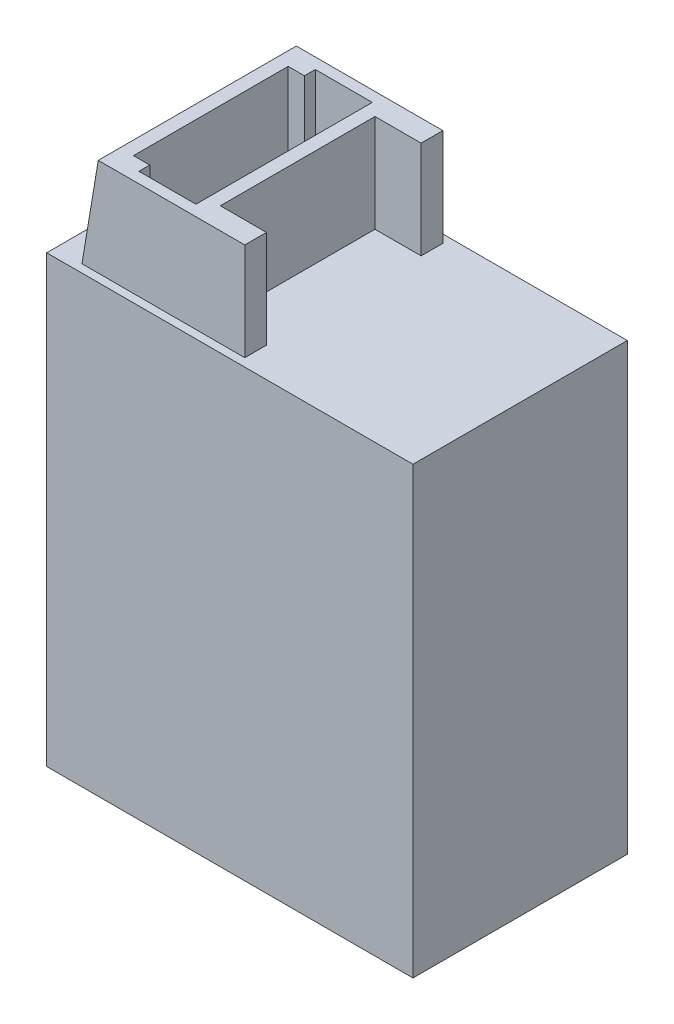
ISO-10303-21;
HEADER;
FILE_DESCRIPTION(('STEP AP214'),'2;1');
FILE_NAME('part.step','',(''),(''),'','','');
FILE_SCHEMA(('AUTOMOTIVE_DESIGN { 1 0 10303 214 1 1 1 1 }'));
ENDSEC;
DATA;
#1=APPLICATION_CONTEXT('core data for automotive mechanical design processes');
#2=APPLICATION_PROTOCOL_DEFINITION('international standard','automotive_design',2000,#1);
#3=PRODUCT_CONTEXT('',#1,'mechanical');
#4=PRODUCT('Part','Part','',(#3));
#5=PRODUCT_RELATED_PRODUCT_CATEGORY('part','',(#4));
#6=PRODUCT_DEFINITION_FORMATION('','',#4);
#7=PRODUCT_DEFINITION_CONTEXT('part definition',#1,'design');
#8=PRODUCT_DEFINITION('design','',#6,#7);
#9=PRODUCT_DEFINITION_SHAPE('','',#8);
#10=(LENGTH_UNIT() NAMED_UNIT(*) SI_UNIT(.MILLI.,.METRE.));
#11=(NAMED_UNIT(*) PLANE_ANGLE_UNIT() SI_UNIT($,.RADIAN.));
#12=(NAMED_UNIT(*) SI_UNIT($,.STERADIAN.) SOLID_ANGLE_UNIT());
#13=UNCERTAINTY_MEASURE_WITH_UNIT(LENGTH_MEASURE(1.E-05),#10,'distance_accuracy_value','');
#14=(GEOMETRIC_REPRESENTATION_CONTEXT(3) GLOBAL_UNCERTAINTY_ASSIGNED_CONTEXT((#13)) GLOBAL_UNIT_ASSIGNED_CONTEXT((#10,
#11,#12)) REPRESENTATION_CONTEXT('',''));
#15=CARTESIAN_POINT('',(0.,0.,0.));
#16=DIRECTION('',(0.,0.,1.));
#17=DIRECTION('',(1.,0.,0.));
#18=AXIS2_PLACEMENT_3D('',#15,#16,#17);
#19=CARTESIAN_POINT('',(0.,20.828,-10.033));
#20=DIRECTION('',(0.,-1.,0.));
#21=DIRECTION('',(0.,0.,-1.));
#22=AXIS2_PLACEMENT_3D('',#19,#20,#21);
#23=PLANE('',#22);
#24=DIRECTION('',(0.,0.,1.));
#25=VECTOR('',#24,1.);
#26=CARTESIAN_POINT('',(0.,20.828,0.));
#27=LINE('',#26,#25);
#28=CARTESIAN_POINT('',(0.,20.828,-10.033));
#29=VERTEX_POINT('',#28);
#30=CARTESIAN_POINT('',(0.,20.828,0.));
#31=VERTEX_POINT('',#30);
#32=EDGE_CURVE('E336',#29,#31,#27,.T.);
#33=ORIENTED_EDGE('',*,*,#32,.T.);
#34=DIRECTION('',(1.,0.,0.));
#35=VECTOR('',#34,1.);
#36=CARTESIAN_POINT('',(0.,20.828,0.));
#37=LINE('',#36,#35);
#38=CARTESIAN_POINT('',(17.145,20.828,0.));
#39=VERTEX_POINT('',#38);
#40=EDGE_CURVE('E339',#31,#39,#37,.T.);
#41=ORIENTED_EDGE('',*,*,#40,.T.);
#42=DIRECTION('',(0.,0.,-1.));
#43=VECTOR('',#42,1.);
#44=CARTESIAN_POINT('',(17.145,20.828,0.));
#45=LINE('',#44,#43);
#46=CARTESIAN_POINT('',(17.145,20.828,-10.033));
#47=VERTEX_POINT('',#46);
#48=EDGE_CURVE('E341',#39,#47,#45,.T.);
#49=ORIENTED_EDGE('',*,*,#48,.T.);
#50=DIRECTION('',(-1.,0.,0.));
#51=VECTOR('',#50,1.);
#52=CARTESIAN_POINT('',(0.,20.828,-10.033));
#53=LINE('',#52,#51);
#54=EDGE_CURVE('E343',#47,#29,#53,.T.);
#55=ORIENTED_EDGE('',*,*,#54,.T.);
#56=EDGE_LOOP('',(#33,#41,#49,#55));
#57=FACE_BOUND('',#56,.T.);
#58=DIRECTION('',(0.,0.,1.));
#59=VECTOR('',#58,1.);
#60=CARTESIAN_POINT('',(1.27,20.828,-0.381));
#61=LINE('',#60,#59);
#62=CARTESIAN_POINT('',(1.27,20.828,-1.397));
#63=VERTEX_POINT('',#62);
#64=CARTESIAN_POINT('',(1.27,20.828,-0.380999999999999));
#65=VERTEX_POINT('',#64);
#66=EDGE_CURVE('E203',#63,#65,#61,.T.);
#67=ORIENTED_EDGE('',*,*,#66,.F.);
#68=DIRECTION('',(-1.,0.,0.));
#69=VECTOR('',#68,1.);
#70=CARTESIAN_POINT('',(1.27,20.828,-1.397));
#71=LINE('',#70,#69);
#72=CARTESIAN_POINT('',(2.032,20.828,-1.397));
#73=VERTEX_POINT('',#72);
#74=EDGE_CURVE('E283',#73,#63,#71,.T.);
#75=ORIENTED_EDGE('',*,*,#74,.F.);
#76=DIRECTION('',(0.,0.,1.));
#77=VECTOR('',#76,1.);
#78=CARTESIAN_POINT('',(2.032,20.828,-1.397));
#79=LINE('',#78,#77);
#80=CARTESIAN_POINT('',(2.032,20.828,-8.636));
#81=VERTEX_POINT('',#80);
#82=EDGE_CURVE('E280',#81,#73,#79,.T.);
#83=ORIENTED_EDGE('',*,*,#82,.F.);
#84=DIRECTION('',(1.,0.,0.));
#85=VECTOR('',#84,1.);
#86=CARTESIAN_POINT('',(1.27,20.828,-8.636));
#87=LINE('',#86,#85);
#88=CARTESIAN_POINT('',(1.27,20.828,-8.636));
#89=VERTEX_POINT('',#88);
#90=EDGE_CURVE('E277',#89,#81,#87,.T.);
#91=ORIENTED_EDGE('',*,*,#90,.F.);
#92=DIRECTION('',(0.,0.,1.));
#93=VECTOR('',#92,1.);
#94=CARTESIAN_POINT('',(1.27,20.828,-8.636));
#95=LINE('',#94,#93);
#96=CARTESIAN_POINT('',(1.27,20.828,-9.652));
#97=VERTEX_POINT('',#96);
#98=EDGE_CURVE('E274',#97,#89,#95,.T.);
#99=ORIENTED_EDGE('',*,*,#98,.F.);
#100=DIRECTION('',(-1.,0.,0.));
#101=VECTOR('',#100,1.);
#102=CARTESIAN_POINT('',(1.27,20.828,-9.652));
#103=LINE('',#102,#101);
#104=CARTESIAN_POINT('',(8.89,20.828,-9.652));
#105=VERTEX_POINT('',#104);
#106=EDGE_CURVE('E272',#105,#97,#103,.T.);
#107=ORIENTED_EDGE('',*,*,#106,.F.);
#108=DIRECTION('',(0.,0.,-1.));
#109=VECTOR('',#108,1.);
#110=CARTESIAN_POINT('',(8.89,20.828,-8.636));
#111=LINE('',#110,#109);
#112=CARTESIAN_POINT('',(8.89,20.828,-8.636));
#113=VERTEX_POINT('',#112);
#114=EDGE_CURVE('E269',#113,#105,#111,.T.);
#115=ORIENTED_EDGE('',*,*,#114,.F.);
#116=DIRECTION('',(1.,0.,0.));
#117=VECTOR('',#116,1.);
#118=CARTESIAN_POINT('',(6.731,20.828,-8.636));
#119=LINE('',#118,#117);
#120=CARTESIAN_POINT('',(6.731,20.828,-8.636));
#121=VERTEX_POINT('',#120);
#122=EDGE_CURVE('E266',#121,#113,#119,.T.);
#123=ORIENTED_EDGE('',*,*,#122,.F.);
#124=DIRECTION('',(0.,0.,-1.));
#125=VECTOR('',#124,1.);
#126=CARTESIAN_POINT('',(6.731,20.828,-8.636));
#127=LINE('',#126,#125);
#128=CARTESIAN_POINT('',(6.731,20.828,-1.397));
#129=VERTEX_POINT('',#128);
#130=EDGE_CURVE('E263',#129,#121,#127,.T.);
#131=ORIENTED_EDGE('',*,*,#130,.F.);
#132=DIRECTION('',(-1.,0.,0.));
#133=VECTOR('',#132,1.);
#134=CARTESIAN_POINT('',(6.731,20.828,-1.397));
#135=LINE('',#134,#133);
#136=CARTESIAN_POINT('',(8.89,20.828,-1.397));
#137=VERTEX_POINT('',#136);
#138=EDGE_CURVE('E260',#137,#129,#135,.T.);
#139=ORIENTED_EDGE('',*,*,#138,.F.);
#140=DIRECTION('',(0.,0.,-1.));
#141=VECTOR('',#140,1.);
#142=CARTESIAN_POINT('',(8.89,20.828,-0.381));
#143=LINE('',#142,#141);
#144=CARTESIAN_POINT('',(8.89,20.828,-0.380999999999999));
#145=VERTEX_POINT('',#144);
#146=EDGE_CURVE('E257',#145,#137,#143,.T.);
#147=ORIENTED_EDGE('',*,*,#146,.F.);
#148=DIRECTION('',(1.,0.,0.));
#149=VECTOR('',#148,1.);
#150=CARTESIAN_POINT('',(1.27,20.828,-0.381));
#151=LINE('',#150,#149);
#152=EDGE_CURVE('E254',#65,#145,#151,.T.);
#153=ORIENTED_EDGE('',*,*,#152,.F.);
#154=EDGE_LOOP('',(#67,#75,#83,#91,#99,#107,#115,#123,#131,#139,#147,#153));
#155=FACE_BOUND('',#154,.T.);
#156=ADVANCED_FACE('F26',(#57,#155),#23,.F.);
#157=CARTESIAN_POINT('',(0.,20.828,0.));
#158=DIRECTION('',(1.,0.,0.));
#159=DIRECTION('',(0.,0.,-1.));
#160=AXIS2_PLACEMENT_3D('',#157,#158,#159);
#161=PLANE('',#160);
#162=DIRECTION('',(0.,0.,1.));
#163=VECTOR('',#162,1.);
#164=CARTESIAN_POINT('',(0.,0.,0.));
#165=LINE('',#164,#163);
#166=CARTESIAN_POINT('',(0.,0.,-10.033));
#167=VERTEX_POINT('',#166);
#168=CARTESIAN_POINT('',(0.,0.,0.));
#169=VERTEX_POINT('',#168);
#170=EDGE_CURVE('E327',#167,#169,#165,.T.);
#171=ORIENTED_EDGE('',*,*,#170,.T.);
#172=DIRECTION('',(0.,-1.,0.));
#173=VECTOR('',#172,1.);
#174=CARTESIAN_POINT('',(0.,20.828,0.));
#175=LINE('',#174,#173);
#176=EDGE_CURVE('E354',#31,#169,#175,.T.);
#177=ORIENTED_EDGE('',*,*,#176,.F.);
#178=ORIENTED_EDGE('',*,*,#32,.F.);
#179=DIRECTION('',(0.,-1.,0.));
#180=VECTOR('',#179,1.);
#181=CARTESIAN_POINT('',(0.,20.828,-10.033));
#182=LINE('',#181,#180);
#183=EDGE_CURVE('E345',#29,#167,#182,.T.);
#184=ORIENTED_EDGE('',*,*,#183,.T.);
#185=EDGE_LOOP('',(#171,#177,#178,#184));
#186=FACE_BOUND('',#185,.T.);
#187=ADVANCED_FACE('F28',(#186),#161,.F.);
#188=CARTESIAN_POINT('',(0.,20.828,0.));
#189=DIRECTION('',(0.,0.,-1.));
#190=DIRECTION('',(-1.,0.,0.));
#191=AXIS2_PLACEMENT_3D('',#188,#189,#190);
#192=PLANE('',#191);
#193=DIRECTION('',(1.,0.,0.));
#194=VECTOR('',#193,1.);
#195=CARTESIAN_POINT('',(0.,0.,0.));
#196=LINE('',#195,#194);
#197=CARTESIAN_POINT('',(17.145,0.,0.));
#198=VERTEX_POINT('',#197);
#199=EDGE_CURVE('E330',#169,#198,#196,.T.);
#200=ORIENTED_EDGE('',*,*,#199,.T.);
#201=DIRECTION('',(0.,-1.,0.));
#202=VECTOR('',#201,1.);
#203=CARTESIAN_POINT('',(17.145,20.828,0.));
#204=LINE('',#203,#202);
#205=EDGE_CURVE('E351',#39,#198,#204,.T.);
#206=ORIENTED_EDGE('',*,*,#205,.F.);
#207=ORIENTED_EDGE('',*,*,#40,.F.);
#208=ORIENTED_EDGE('',*,*,#176,.T.);
#209=EDGE_LOOP('',(#200,#206,#207,#208));
#210=FACE_BOUND('',#209,.T.);
#211=ADVANCED_FACE('F425',(#210),#192,.F.);
#212=CARTESIAN_POINT('',(17.145,20.828,0.));
#213=DIRECTION('',(-1.,0.,0.));
#214=DIRECTION('',(0.,0.,1.));
#215=AXIS2_PLACEMENT_3D('',#212,#213,#214);
#216=PLANE('',#215);
#217=DIRECTION('',(0.,0.,-1.));
#218=VECTOR('',#217,1.);
#219=CARTESIAN_POINT('',(17.145,0.,0.));
#220=LINE('',#219,#218);
#221=CARTESIAN_POINT('',(17.145,0.,-10.033));
#222=VERTEX_POINT('',#221);
#223=EDGE_CURVE('E332',#198,#222,#220,.T.);
#224=ORIENTED_EDGE('',*,*,#223,.T.);
#225=DIRECTION('',(0.,-1.,0.));
#226=VECTOR('',#225,1.);
#227=CARTESIAN_POINT('',(17.145,20.828,-10.033));
#228=LINE('',#227,#226);
#229=EDGE_CURVE('E348',#47,#222,#228,.T.);
#230=ORIENTED_EDGE('',*,*,#229,.F.);
#231=ORIENTED_EDGE('',*,*,#48,.F.);
#232=ORIENTED_EDGE('',*,*,#205,.T.);
#233=EDGE_LOOP('',(#224,#230,#231,#232));
#234=FACE_BOUND('',#233,.T.);
#235=ADVANCED_FACE('F477',(#234),#216,.F.);
#236=CARTESIAN_POINT('',(0.,20.828,-10.033));
#237=DIRECTION('',(0.,0.,1.));
#238=DIRECTION('',(1.,0.,0.));
#239=AXIS2_PLACEMENT_3D('',#236,#237,#238);
#240=PLANE('',#239);
#241=DIRECTION('',(-1.,0.,0.));
#242=VECTOR('',#241,1.);
#243=CARTESIAN_POINT('',(0.,0.,-10.033));
#244=LINE('',#243,#242);
#245=EDGE_CURVE('E334',#222,#167,#244,.T.);
#246=ORIENTED_EDGE('',*,*,#245,.T.);
#247=ORIENTED_EDGE('',*,*,#183,.F.);
#248=ORIENTED_EDGE('',*,*,#54,.F.);
#249=ORIENTED_EDGE('',*,*,#229,.T.);
#250=EDGE_LOOP('',(#246,#247,#248,#249));
#251=FACE_BOUND('',#250,.T.);
#252=ADVANCED_FACE('F471',(#251),#240,.F.);
#253=CARTESIAN_POINT('',(0.,0.,-10.033));
#254=DIRECTION('',(0.,-1.,0.));
#255=DIRECTION('',(0.,0.,-1.));
#256=AXIS2_PLACEMENT_3D('',#253,#254,#255);
#257=PLANE('',#256);
#258=ORIENTED_EDGE('',*,*,#170,.F.);
#259=ORIENTED_EDGE('',*,*,#245,.F.);
#260=ORIENTED_EDGE('',*,*,#223,.F.);
#261=ORIENTED_EDGE('',*,*,#199,.F.);
#262=EDGE_LOOP('',(#258,#259,#260,#261));
#263=FACE_BOUND('',#262,.T.);
#264=ADVANCED_FACE('F465',(#263),#257,.T.);
#265=CARTESIAN_POINT('',(1.27,25.4,-1.397));
#266=DIRECTION('',(0.,-1.,0.));
#267=DIRECTION('',(0.,0.,-1.));
#268=AXIS2_PLACEMENT_3D('',#265,#266,#267);
#269=PLANE('',#268);
#270=DIRECTION('',(0.,0.,1.));
#271=VECTOR('',#270,1.);
#272=CARTESIAN_POINT('',(2.032,25.4,-1.397));
#273=LINE('',#272,#271);
#274=CARTESIAN_POINT('',(2.032,25.4,-8.636));
#275=VERTEX_POINT('',#274);
#276=CARTESIAN_POINT('',(2.032,25.4,-1.397));
#277=VERTEX_POINT('',#276);
#278=EDGE_CURVE('E300',#275,#277,#273,.T.);
#279=ORIENTED_EDGE('',*,*,#278,.T.);
#280=DIRECTION('',(0.,0.,1.));
#281=VECTOR('',#280,1.);
#282=CARTESIAN_POINT('',(2.032,25.4,-1.397));
#283=LINE('',#282,#281);
#284=CARTESIAN_POINT('',(2.032,25.4,-0.381));
#285=VERTEX_POINT('',#284);
#286=EDGE_CURVE('E360',#277,#285,#283,.T.);
#287=ORIENTED_EDGE('',*,*,#286,.T.);
#288=DIRECTION('',(1.,0.,0.));
#289=VECTOR('',#288,1.);
#290=CARTESIAN_POINT('',(1.27,25.4,-0.381));
#291=LINE('',#290,#289);
#292=CARTESIAN_POINT('',(8.89,25.4,-0.381));
#293=VERTEX_POINT('',#292);
#294=EDGE_CURVE('E286',#285,#293,#291,.T.);
#295=ORIENTED_EDGE('',*,*,#294,.T.);
#296=DIRECTION('',(0.,0.,-1.));
#297=VECTOR('',#296,1.);
#298=CARTESIAN_POINT('',(8.89,25.4,-0.381));
#299=LINE('',#298,#297);
#300=CARTESIAN_POINT('',(8.89,25.4,-1.397));
#301=VERTEX_POINT('',#300);
#302=EDGE_CURVE('E288',#293,#301,#299,.T.);
#303=ORIENTED_EDGE('',*,*,#302,.T.);
#304=DIRECTION('',(-1.,0.,0.));
#305=VECTOR('',#304,1.);
#306=CARTESIAN_POINT('',(6.731,25.4,-1.397));
#307=LINE('',#306,#305);
#308=CARTESIAN_POINT('',(6.731,25.4,-1.397));
#309=VERTEX_POINT('',#308);
#310=EDGE_CURVE('E290',#301,#309,#307,.T.);
#311=ORIENTED_EDGE('',*,*,#310,.T.);
#312=DIRECTION('',(0.,0.,-1.));
#313=VECTOR('',#312,1.);
#314=CARTESIAN_POINT('',(6.731,25.4,-8.636));
#315=LINE('',#314,#313);
#316=CARTESIAN_POINT('',(6.731,25.4,-8.636));
#317=VERTEX_POINT('',#316);
#318=EDGE_CURVE('E292',#309,#317,#315,.T.);
#319=ORIENTED_EDGE('',*,*,#318,.T.);
#320=DIRECTION('',(1.,0.,0.));
#321=VECTOR('',#320,1.);
#322=CARTESIAN_POINT('',(6.731,25.4,-8.636));
#323=LINE('',#322,#321);
#324=CARTESIAN_POINT('',(8.89,25.4,-8.636));
#325=VERTEX_POINT('',#324);
#326=EDGE_CURVE('E294',#317,#325,#323,.T.);
#327=ORIENTED_EDGE('',*,*,#326,.T.);
#328=DIRECTION('',(0.,0.,-1.));
#329=VECTOR('',#328,1.);
#330=CARTESIAN_POINT('',(8.89,25.4,-8.636));
#331=LINE('',#330,#329);
#332=CARTESIAN_POINT('',(8.89,25.4,-9.652));
#333=VERTEX_POINT('',#332);
#334=EDGE_CURVE('E296',#325,#333,#331,.T.);
#335=ORIENTED_EDGE('',*,*,#334,.T.);
#336=DIRECTION('',(-1.,0.,0.));
#337=VECTOR('',#336,1.);
#338=CARTESIAN_POINT('',(1.27,25.4,-9.652));
#339=LINE('',#338,#337);
#340=CARTESIAN_POINT('',(2.032,25.4,-9.652));
#341=VERTEX_POINT('',#340);
#342=EDGE_CURVE('E298',#333,#341,#339,.T.);
#343=ORIENTED_EDGE('',*,*,#342,.T.);
#344=DIRECTION('',(0.,0.,1.));
#345=VECTOR('',#344,1.);
#346=CARTESIAN_POINT('',(2.032,25.4,-1.397));
#347=LINE('',#346,#345);
#348=EDGE_CURVE('E357',#341,#275,#347,.T.);
#349=ORIENTED_EDGE('',*,*,#348,.T.);
#350=EDGE_LOOP('',(#279,#287,#295,#303,#311,#319,#327,#335,#343,#349));
#351=FACE_BOUND('',#350,.T.);
#352=DIRECTION('',(1.,0.,0.));
#353=VECTOR('',#352,1.);
#354=CARTESIAN_POINT('',(3.429,25.4,-0.889000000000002));
#355=LINE('',#354,#353);
#356=CARTESIAN_POINT('',(3.429,25.4,-0.889000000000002));
#357=VERTEX_POINT('',#356);
#358=CARTESIAN_POINT('',(6.096,25.4,-0.889000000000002));
#359=VERTEX_POINT('',#358);
#360=EDGE_CURVE('E202',#357,#359,#355,.T.);
#361=ORIENTED_EDGE('',*,*,#360,.F.);
#362=DIRECTION('',(0.,0.,1.));
#363=VECTOR('',#362,1.);
#364=CARTESIAN_POINT('',(3.429,25.4,-1.397));
#365=LINE('',#364,#363);
#366=CARTESIAN_POINT('',(3.429,25.4,-1.397));
#367=VERTEX_POINT('',#366);
#368=EDGE_CURVE('E238',#367,#357,#365,.T.);
#369=ORIENTED_EDGE('',*,*,#368,.F.);
#370=DIRECTION('',(1.,0.,0.));
#371=VECTOR('',#370,1.);
#372=CARTESIAN_POINT('',(2.667,25.4,-1.397));
#373=LINE('',#372,#371);
#374=CARTESIAN_POINT('',(2.667,25.4,-1.397));
#375=VERTEX_POINT('',#374);
#376=EDGE_CURVE('E235',#375,#367,#373,.T.);
#377=ORIENTED_EDGE('',*,*,#376,.F.);
#378=DIRECTION('',(0.,0.,1.));
#379=VECTOR('',#378,1.);
#380=CARTESIAN_POINT('',(2.667,25.4,-1.397));
#381=LINE('',#380,#379);
#382=CARTESIAN_POINT('',(2.667,25.4,-8.636));
#383=VERTEX_POINT('',#382);
#384=EDGE_CURVE('E233',#383,#375,#381,.T.);
#385=ORIENTED_EDGE('',*,*,#384,.F.);
#386=DIRECTION('',(-1.,0.,0.));
#387=VECTOR('',#386,1.);
#388=CARTESIAN_POINT('',(2.667,25.4,-8.636));
#389=LINE('',#388,#387);
#390=CARTESIAN_POINT('',(3.429,25.4,-8.636));
#391=VERTEX_POINT('',#390);
#392=EDGE_CURVE('E231',#391,#383,#389,.T.);
#393=ORIENTED_EDGE('',*,*,#392,.F.);
#394=DIRECTION('',(0.,0.,1.));
#395=VECTOR('',#394,1.);
#396=CARTESIAN_POINT('',(3.429,25.4,-8.636));
#397=LINE('',#396,#395);
#398=CARTESIAN_POINT('',(3.429,25.4,-9.144));
#399=VERTEX_POINT('',#398);
#400=EDGE_CURVE('E229',#399,#391,#397,.T.);
#401=ORIENTED_EDGE('',*,*,#400,.F.);
#402=DIRECTION('',(-1.,0.,0.));
#403=VECTOR('',#402,1.);
#404=CARTESIAN_POINT('',(3.429,25.4,-9.144));
#405=LINE('',#404,#403);
#406=CARTESIAN_POINT('',(6.096,25.4,-9.144));
#407=VERTEX_POINT('',#406);
#408=EDGE_CURVE('E227',#407,#399,#405,.T.);
#409=ORIENTED_EDGE('',*,*,#408,.F.);
#410=DIRECTION('',(0.,0.,-1.));
#411=VECTOR('',#410,1.);
#412=CARTESIAN_POINT('',(6.096,25.4,-9.144));
#413=LINE('',#412,#411);
#414=EDGE_CURVE('E225',#359,#407,#413,.T.);
#415=ORIENTED_EDGE('',*,*,#414,.F.);
#416=EDGE_LOOP('',(#361,#369,#377,#385,#393,#401,#409,#415));
#417=FACE_BOUND('',#416,.T.);
#418=ADVANCED_FACE('F374',(#351,#417),#269,.F.);
#419=CARTESIAN_POINT('',(1.27,25.4,-0.381));
#420=DIRECTION('',(0.,0.,-1.));
#421=DIRECTION('',(-1.,0.,0.));
#422=AXIS2_PLACEMENT_3D('',#419,#420,#421);
#423=PLANE('',#422);
#424=ORIENTED_EDGE('',*,*,#294,.F.);
#425=DIRECTION('',(0.164398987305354,0.986393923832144,0.));
#426=VECTOR('',#425,1.);
#427=CARTESIAN_POINT('',(2.032,25.4,-0.381));
#428=LINE('',#427,#426);
#429=EDGE_CURVE('E47',#285,#65,#428,.F.);
#430=ORIENTED_EDGE('',*,*,#429,.T.);
#431=ORIENTED_EDGE('',*,*,#152,.T.);
#432=DIRECTION('',(0.,-1.,0.));
#433=VECTOR('',#432,1.);
#434=CARTESIAN_POINT('',(8.89,25.4,-0.381));
#435=LINE('',#434,#433);
#436=EDGE_CURVE('E324',#293,#145,#435,.T.);
#437=ORIENTED_EDGE('',*,*,#436,.F.);
#438=EDGE_LOOP('',(#424,#430,#431,#437));
#439=FACE_BOUND('',#438,.T.);
#440=ADVANCED_FACE('F402',(#439),#423,.F.);
#441=CARTESIAN_POINT('',(8.89,25.4,-0.381));
#442=DIRECTION('',(-1.,0.,0.));
#443=DIRECTION('',(0.,0.,1.));
#444=AXIS2_PLACEMENT_3D('',#441,#442,#443);
#445=PLANE('',#444);
#446=ORIENTED_EDGE('',*,*,#146,.T.);
#447=DIRECTION('',(0.,-1.,0.));
#448=VECTOR('',#447,1.);
#449=CARTESIAN_POINT('',(8.89,25.4,-1.397));
#450=LINE('',#449,#448);
#451=EDGE_CURVE('E321',#301,#137,#450,.T.);
#452=ORIENTED_EDGE('',*,*,#451,.F.);
#453=ORIENTED_EDGE('',*,*,#302,.F.);
#454=ORIENTED_EDGE('',*,*,#436,.T.);
#455=EDGE_LOOP('',(#446,#452,#453,#454));
#456=FACE_BOUND('',#455,.T.);
#457=ADVANCED_FACE('F397',(#456),#445,.F.);
#458=CARTESIAN_POINT('',(6.731,25.4,-1.397));
#459=DIRECTION('',(0.,0.,1.));
#460=DIRECTION('',(1.,0.,0.));
#461=AXIS2_PLACEMENT_3D('',#458,#459,#460);
#462=PLANE('',#461);
#463=ORIENTED_EDGE('',*,*,#138,.T.);
#464=DIRECTION('',(0.,-1.,0.));
#465=VECTOR('',#464,1.);
#466=CARTESIAN_POINT('',(6.731,25.4,-1.397));
#467=LINE('',#466,#465);
#468=EDGE_CURVE('E318',#309,#129,#467,.T.);
#469=ORIENTED_EDGE('',*,*,#468,.F.);
#470=ORIENTED_EDGE('',*,*,#310,.F.);
#471=ORIENTED_EDGE('',*,*,#451,.T.);
#472=EDGE_LOOP('',(#463,#469,#470,#471));
#473=FACE_BOUND('',#472,.T.);
#474=ADVANCED_FACE('F392',(#473),#462,.F.);
#475=CARTESIAN_POINT('',(6.731,25.4,-8.636));
#476=DIRECTION('',(-1.,0.,0.));
#477=DIRECTION('',(0.,0.,1.));
#478=AXIS2_PLACEMENT_3D('',#475,#476,#477);
#479=PLANE('',#478);
#480=ORIENTED_EDGE('',*,*,#130,.T.);
#481=DIRECTION('',(0.,-1.,0.));
#482=VECTOR('',#481,1.);
#483=CARTESIAN_POINT('',(6.731,25.4,-8.636));
#484=LINE('',#483,#482);
#485=EDGE_CURVE('E315',#317,#121,#484,.T.);
#486=ORIENTED_EDGE('',*,*,#485,.F.);
#487=ORIENTED_EDGE('',*,*,#318,.F.);
#488=ORIENTED_EDGE('',*,*,#468,.T.);
#489=EDGE_LOOP('',(#480,#486,#487,#488));
#490=FACE_BOUND('',#489,.T.);
#491=ADVANCED_FACE('F389',(#490),#479,.F.);
#492=CARTESIAN_POINT('',(6.731,25.4,-8.636));
#493=DIRECTION('',(0.,0.,-1.));
#494=DIRECTION('',(-1.,0.,0.));
#495=AXIS2_PLACEMENT_3D('',#492,#493,#494);
#496=PLANE('',#495);
#497=ORIENTED_EDGE('',*,*,#122,.T.);
#498=DIRECTION('',(0.,-1.,0.));
#499=VECTOR('',#498,1.);
#500=CARTESIAN_POINT('',(8.89,25.4,-8.636));
#501=LINE('',#500,#499);
#502=EDGE_CURVE('E312',#325,#113,#501,.T.);
#503=ORIENTED_EDGE('',*,*,#502,.F.);
#504=ORIENTED_EDGE('',*,*,#326,.F.);
#505=ORIENTED_EDGE('',*,*,#485,.T.);
#506=EDGE_LOOP('',(#497,#503,#504,#505));
#507=FACE_BOUND('',#506,.T.);
#508=ADVANCED_FACE('F384',(#507),#496,.F.);
#509=CARTESIAN_POINT('',(8.89,25.4,-8.636));
#510=DIRECTION('',(-1.,0.,0.));
#511=DIRECTION('',(0.,0.,1.));
#512=AXIS2_PLACEMENT_3D('',#509,#510,#511);
#513=PLANE('',#512);
#514=ORIENTED_EDGE('',*,*,#114,.T.);
#515=DIRECTION('',(0.,-1.,0.));
#516=VECTOR('',#515,1.);
#517=CARTESIAN_POINT('',(8.89,25.4,-9.652));
#518=LINE('',#517,#516);
#519=EDGE_CURVE('E309',#333,#105,#518,.T.);
#520=ORIENTED_EDGE('',*,*,#519,.F.);
#521=ORIENTED_EDGE('',*,*,#334,.F.);
#522=ORIENTED_EDGE('',*,*,#502,.T.);
#523=EDGE_LOOP('',(#514,#520,#521,#522));
#524=FACE_BOUND('',#523,.T.);
#525=ADVANCED_FACE('F381',(#524),#513,.F.);
#526=CARTESIAN_POINT('',(1.27,25.4,-9.652));
#527=DIRECTION('',(0.,0.,1.));
#528=DIRECTION('',(1.,0.,0.));
#529=AXIS2_PLACEMENT_3D('',#526,#527,#528);
#530=PLANE('',#529);
#531=ORIENTED_EDGE('',*,*,#106,.T.);
#532=DIRECTION('',(-0.164398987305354,-0.986393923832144,0.));
#533=VECTOR('',#532,1.);
#534=CARTESIAN_POINT('',(2.032,25.4,-9.652));
#535=LINE('',#534,#533);
#536=EDGE_CURVE('E11',#97,#341,#535,.F.);
#537=ORIENTED_EDGE('',*,*,#536,.T.);
#538=ORIENTED_EDGE('',*,*,#342,.F.);
#539=ORIENTED_EDGE('',*,*,#519,.T.);
#540=EDGE_LOOP('',(#531,#537,#538,#539));
#541=FACE_BOUND('',#540,.T.);
#542=ADVANCED_FACE('F379',(#541),#530,.F.);
#543=CARTESIAN_POINT('',(1.27,25.4,-8.636));
#544=DIRECTION('',(0.,0.,-1.));
#545=DIRECTION('',(-1.,0.,0.));
#546=AXIS2_PLACEMENT_3D('',#543,#544,#545);
#547=PLANE('',#546);
#548=DIRECTION('',(0.,-1.,0.));
#549=VECTOR('',#548,1.);
#550=CARTESIAN_POINT('',(2.032,25.4,-8.636));
#551=LINE('',#550,#549);
#552=EDGE_CURVE('E306',#275,#81,#551,.T.);
#553=ORIENTED_EDGE('',*,*,#552,.F.);
#554=DIRECTION('',(0.164398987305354,0.986393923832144,0.));
#555=VECTOR('',#554,1.);
#556=CARTESIAN_POINT('',(2.032,25.4,-8.636));
#557=LINE('',#556,#555);
#558=EDGE_CURVE('E34',#275,#89,#557,.F.);
#559=ORIENTED_EDGE('',*,*,#558,.T.);
#560=ORIENTED_EDGE('',*,*,#90,.T.);
#561=EDGE_LOOP('',(#553,#559,#560));
#562=FACE_BOUND('',#561,.T.);
#563=ADVANCED_FACE('F367',(#562),#547,.F.);
#564=CARTESIAN_POINT('',(2.032,25.4,-1.397));
#565=DIRECTION('',(1.,0.,0.));
#566=DIRECTION('',(0.,0.,-1.));
#567=AXIS2_PLACEMENT_3D('',#564,#565,#566);
#568=PLANE('',#567);
#569=ORIENTED_EDGE('',*,*,#82,.T.);
#570=DIRECTION('',(0.,-1.,0.));
#571=VECTOR('',#570,1.);
#572=CARTESIAN_POINT('',(2.032,25.4,-1.397));
#573=LINE('',#572,#571);
#574=EDGE_CURVE('E303',#277,#73,#573,.T.);
#575=ORIENTED_EDGE('',*,*,#574,.F.);
#576=ORIENTED_EDGE('',*,*,#278,.F.);
#577=ORIENTED_EDGE('',*,*,#552,.T.);
#578=EDGE_LOOP('',(#569,#575,#576,#577));
#579=FACE_BOUND('',#578,.T.);
#580=ADVANCED_FACE('F408',(#579),#568,.F.);
#581=CARTESIAN_POINT('',(1.27,25.4,-1.397));
#582=DIRECTION('',(0.,0.,1.));
#583=DIRECTION('',(1.,0.,0.));
#584=AXIS2_PLACEMENT_3D('',#581,#582,#583);
#585=PLANE('',#584);
#586=ORIENTED_EDGE('',*,*,#74,.T.);
#587=DIRECTION('',(-0.164398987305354,-0.986393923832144,0.));
#588=VECTOR('',#587,1.);
#589=CARTESIAN_POINT('',(2.032,25.4,-1.397));
#590=LINE('',#589,#588);
#591=EDGE_CURVE('E363',#63,#277,#590,.F.);
#592=ORIENTED_EDGE('',*,*,#591,.T.);
#593=ORIENTED_EDGE('',*,*,#574,.T.);
#594=EDGE_LOOP('',(#586,#592,#593));
#595=FACE_BOUND('',#594,.T.);
#596=ADVANCED_FACE('F406',(#595),#585,.F.);
#597=CARTESIAN_POINT('',(3.429,25.4,-0.889000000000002));
#598=DIRECTION('',(0.,0.,-1.));
#599=DIRECTION('',(-1.,0.,0.));
#600=AXIS2_PLACEMENT_3D('',#597,#598,#599);
#601=PLANE('',#600);
#602=DIRECTION('',(1.,0.,0.));
#603=VECTOR('',#602,1.);
#604=CARTESIAN_POINT('',(3.429,20.828,-0.889000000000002));
#605=LINE('',#604,#603);
#606=CARTESIAN_POINT('',(3.429,20.828,-0.889000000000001));
#607=VERTEX_POINT('',#606);
#608=CARTESIAN_POINT('',(6.096,20.828,-0.889000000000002));
#609=VERTEX_POINT('',#608);
#610=EDGE_CURVE('E194',#607,#609,#605,.T.);
#611=ORIENTED_EDGE('',*,*,#610,.F.);
#612=DIRECTION('',(0.,-1.,0.));
#613=VECTOR('',#612,1.);
#614=CARTESIAN_POINT('',(3.429,25.4,-0.889000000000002));
#615=LINE('',#614,#613);
#616=EDGE_CURVE('E240',#357,#607,#615,.T.);
#617=ORIENTED_EDGE('',*,*,#616,.F.);
#618=ORIENTED_EDGE('',*,*,#360,.T.);
#619=DIRECTION('',(0.,-1.,0.));
#620=VECTOR('',#619,1.);
#621=CARTESIAN_POINT('',(6.096,25.4,-0.889000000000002));
#622=LINE('',#621,#620);
#623=EDGE_CURVE('E185',#359,#609,#622,.T.);
#624=ORIENTED_EDGE('',*,*,#623,.T.);
#625=EDGE_LOOP('',(#611,#617,#618,#624));
#626=FACE_BOUND('',#625,.T.);
#627=ADVANCED_FACE('F198',(#626),#601,.T.);
#628=CARTESIAN_POINT('',(6.096,25.4,-9.144));
#629=DIRECTION('',(-1.,0.,0.));
#630=DIRECTION('',(0.,0.,1.));
#631=AXIS2_PLACEMENT_3D('',#628,#629,#630);
#632=PLANE('',#631);
#633=DIRECTION('',(0.,0.,-1.));
#634=VECTOR('',#633,1.);
#635=CARTESIAN_POINT('',(6.096,20.828,-9.144));
#636=LINE('',#635,#634);
#637=CARTESIAN_POINT('',(6.096,20.828,-9.144));
#638=VERTEX_POINT('',#637);
#639=EDGE_CURVE('E182',#609,#638,#636,.T.);
#640=ORIENTED_EDGE('',*,*,#639,.F.);
#641=ORIENTED_EDGE('',*,*,#623,.F.);
#642=ORIENTED_EDGE('',*,*,#414,.T.);
#643=DIRECTION('',(0.,-1.,0.));
#644=VECTOR('',#643,1.);
#645=CARTESIAN_POINT('',(6.096,25.4,-9.144));
#646=LINE('',#645,#644);
#647=EDGE_CURVE('E188',#407,#638,#646,.T.);
#648=ORIENTED_EDGE('',*,*,#647,.T.);
#649=EDGE_LOOP('',(#640,#641,#642,#648));
#650=FACE_BOUND('',#649,.T.);
#651=ADVANCED_FACE('F184',(#650),#632,.T.);
#652=CARTESIAN_POINT('',(3.429,25.4,-9.144));
#653=DIRECTION('',(0.,0.,1.));
#654=DIRECTION('',(1.,0.,0.));
#655=AXIS2_PLACEMENT_3D('',#652,#653,#654);
#656=PLANE('',#655);
#657=DIRECTION('',(-1.,0.,0.));
#658=VECTOR('',#657,1.);
#659=CARTESIAN_POINT('',(3.429,20.828,-9.144));
#660=LINE('',#659,#658);
#661=CARTESIAN_POINT('',(3.429,20.828,-9.144));
#662=VERTEX_POINT('',#661);
#663=EDGE_CURVE('E193',#638,#662,#660,.T.);
#664=ORIENTED_EDGE('',*,*,#663,.F.);
#665=ORIENTED_EDGE('',*,*,#647,.F.);
#666=ORIENTED_EDGE('',*,*,#408,.T.);
#667=DIRECTION('',(0.,-1.,0.));
#668=VECTOR('',#667,1.);
#669=CARTESIAN_POINT('',(3.429,25.4,-9.144));
#670=LINE('',#669,#668);
#671=EDGE_CURVE('E250',#399,#662,#670,.T.);
#672=ORIENTED_EDGE('',*,*,#671,.T.);
#673=EDGE_LOOP('',(#664,#665,#666,#672));
#674=FACE_BOUND('',#673,.T.);
#675=ADVANCED_FACE('F456',(#674),#656,.T.);
#676=CARTESIAN_POINT('',(3.429,25.4,-8.636));
#677=DIRECTION('',(1.,0.,0.));
#678=DIRECTION('',(0.,0.,-1.));
#679=AXIS2_PLACEMENT_3D('',#676,#677,#678);
#680=PLANE('',#679);
#681=DIRECTION('',(0.,0.,1.));
#682=VECTOR('',#681,1.);
#683=CARTESIAN_POINT('',(3.429,20.828,-8.636));
#684=LINE('',#683,#682);
#685=CARTESIAN_POINT('',(3.429,20.828,-8.636));
#686=VERTEX_POINT('',#685);
#687=EDGE_CURVE('E212',#662,#686,#684,.T.);
#688=ORIENTED_EDGE('',*,*,#687,.F.);
#689=ORIENTED_EDGE('',*,*,#671,.F.);
#690=ORIENTED_EDGE('',*,*,#400,.T.);
#691=DIRECTION('',(0.,-1.,0.));
#692=VECTOR('',#691,1.);
#693=CARTESIAN_POINT('',(3.429,25.4,-8.636));
#694=LINE('',#693,#692);
#695=EDGE_CURVE('E248',#391,#686,#694,.T.);
#696=ORIENTED_EDGE('',*,*,#695,.T.);
#697=EDGE_LOOP('',(#688,#689,#690,#696));
#698=FACE_BOUND('',#697,.T.);
#699=ADVANCED_FACE('F452',(#698),#680,.T.);
#700=CARTESIAN_POINT('',(2.667,25.4,-8.636));
#701=DIRECTION('',(0.,0.,1.));
#702=DIRECTION('',(1.,0.,0.));
#703=AXIS2_PLACEMENT_3D('',#700,#701,#702);
#704=PLANE('',#703);
#705=DIRECTION('',(-1.,0.,0.));
#706=VECTOR('',#705,1.);
#707=CARTESIAN_POINT('',(2.667,20.828,-8.636));
#708=LINE('',#707,#706);
#709=CARTESIAN_POINT('',(2.667,20.828,-8.636));
#710=VERTEX_POINT('',#709);
#711=EDGE_CURVE('E215',#686,#710,#708,.T.);
#712=ORIENTED_EDGE('',*,*,#711,.F.);
#713=ORIENTED_EDGE('',*,*,#695,.F.);
#714=ORIENTED_EDGE('',*,*,#392,.T.);
#715=DIRECTION('',(0.,-1.,0.));
#716=VECTOR('',#715,1.);
#717=CARTESIAN_POINT('',(2.667,25.4,-8.636));
#718=LINE('',#717,#716);
#719=EDGE_CURVE('E246',#383,#710,#718,.T.);
#720=ORIENTED_EDGE('',*,*,#719,.T.);
#721=EDGE_LOOP('',(#712,#713,#714,#720));
#722=FACE_BOUND('',#721,.T.);
#723=ADVANCED_FACE('F448',(#722),#704,.T.);
#724=CARTESIAN_POINT('',(2.667,25.4,-1.397));
#725=DIRECTION('',(1.,0.,0.));
#726=DIRECTION('',(0.,0.,-1.));
#727=AXIS2_PLACEMENT_3D('',#724,#725,#726);
#728=PLANE('',#727);
#729=DIRECTION('',(0.,0.,1.));
#730=VECTOR('',#729,1.);
#731=CARTESIAN_POINT('',(2.667,20.828,-1.397));
#732=LINE('',#731,#730);
#733=CARTESIAN_POINT('',(2.667,20.828,-1.397));
#734=VERTEX_POINT('',#733);
#735=EDGE_CURVE('E218',#710,#734,#732,.T.);
#736=ORIENTED_EDGE('',*,*,#735,.F.);
#737=ORIENTED_EDGE('',*,*,#719,.F.);
#738=ORIENTED_EDGE('',*,*,#384,.T.);
#739=DIRECTION('',(0.,-1.,0.));
#740=VECTOR('',#739,1.);
#741=CARTESIAN_POINT('',(2.667,25.4,-1.397));
#742=LINE('',#741,#740);
#743=EDGE_CURVE('E244',#375,#734,#742,.T.);
#744=ORIENTED_EDGE('',*,*,#743,.T.);
#745=EDGE_LOOP('',(#736,#737,#738,#744));
#746=FACE_BOUND('',#745,.T.);
#747=ADVANCED_FACE('F441',(#746),#728,.T.);
#748=CARTESIAN_POINT('',(2.667,25.4,-1.397));
#749=DIRECTION('',(0.,0.,-1.));
#750=DIRECTION('',(-1.,0.,0.));
#751=AXIS2_PLACEMENT_3D('',#748,#749,#750);
#752=PLANE('',#751);
#753=DIRECTION('',(1.,0.,0.));
#754=VECTOR('',#753,1.);
#755=CARTESIAN_POINT('',(2.667,20.828,-1.397));
#756=LINE('',#755,#754);
#757=CARTESIAN_POINT('',(3.429,20.828,-1.397));
#758=VERTEX_POINT('',#757);
#759=EDGE_CURVE('E221',#734,#758,#756,.T.);
#760=ORIENTED_EDGE('',*,*,#759,.F.);
#761=ORIENTED_EDGE('',*,*,#743,.F.);
#762=ORIENTED_EDGE('',*,*,#376,.T.);
#763=DIRECTION('',(0.,-1.,0.));
#764=VECTOR('',#763,1.);
#765=CARTESIAN_POINT('',(3.429,25.4,-1.397));
#766=LINE('',#765,#764);
#767=EDGE_CURVE('E242',#367,#758,#766,.T.);
#768=ORIENTED_EDGE('',*,*,#767,.T.);
#769=EDGE_LOOP('',(#760,#761,#762,#768));
#770=FACE_BOUND('',#769,.T.);
#771=ADVANCED_FACE('F435',(#770),#752,.T.);
#772=CARTESIAN_POINT('',(3.429,25.4,-1.397));
#773=DIRECTION('',(1.,0.,0.));
#774=DIRECTION('',(0.,0.,-1.));
#775=AXIS2_PLACEMENT_3D('',#772,#773,#774);
#776=PLANE('',#775);
#777=DIRECTION('',(0.,0.,1.));
#778=VECTOR('',#777,1.);
#779=CARTESIAN_POINT('',(3.429,20.828,-1.397));
#780=LINE('',#779,#778);
#781=EDGE_CURVE('E208',#758,#607,#780,.T.);
#782=ORIENTED_EDGE('',*,*,#781,.F.);
#783=ORIENTED_EDGE('',*,*,#767,.F.);
#784=ORIENTED_EDGE('',*,*,#368,.T.);
#785=ORIENTED_EDGE('',*,*,#616,.T.);
#786=EDGE_LOOP('',(#782,#783,#784,#785));
#787=FACE_BOUND('',#786,.T.);
#788=ADVANCED_FACE('F429',(#787),#776,.T.);
#789=ORIENTED_EDGE('',*,*,#781,.T.);
#790=ORIENTED_EDGE('',*,*,#610,.T.);
#791=ORIENTED_EDGE('',*,*,#639,.T.);
#792=ORIENTED_EDGE('',*,*,#663,.T.);
#793=ORIENTED_EDGE('',*,*,#687,.T.);
#794=ORIENTED_EDGE('',*,*,#711,.T.);
#795=ORIENTED_EDGE('',*,*,#735,.T.);
#796=ORIENTED_EDGE('',*,*,#759,.T.);
#797=EDGE_LOOP('',(#789,#790,#791,#792,#793,#794,#795,#796));
#798=FACE_BOUND('',#797,.T.);
#799=ADVANCED_FACE('F205',(#798),#23,.F.);
#800=CARTESIAN_POINT('',(2.032,25.4,-1.397));
#801=DIRECTION('',(0.986393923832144,-0.164398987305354,0.));
#802=DIRECTION('',(0.164398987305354,0.986393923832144,0.));
#803=AXIS2_PLACEMENT_3D('',#800,#801,#802);
#804=PLANE('',#803);
#805=ORIENTED_EDGE('',*,*,#591,.F.);
#806=ORIENTED_EDGE('',*,*,#66,.T.);
#807=ORIENTED_EDGE('',*,*,#429,.F.);
#808=ORIENTED_EDGE('',*,*,#286,.F.);
#809=EDGE_LOOP('',(#805,#806,#807,#808));
#810=FACE_BOUND('',#809,.T.);
#811=ADVANCED_FACE('F404',(#810),#804,.F.);
#812=CARTESIAN_POINT('',(2.032,25.4,-1.397));
#813=DIRECTION('',(0.986393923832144,-0.164398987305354,0.));
#814=DIRECTION('',(0.164398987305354,0.986393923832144,0.));
#815=AXIS2_PLACEMENT_3D('',#812,#813,#814);
#816=PLANE('',#815);
#817=ORIENTED_EDGE('',*,*,#536,.F.);
#818=ORIENTED_EDGE('',*,*,#98,.T.);
#819=ORIENTED_EDGE('',*,*,#558,.F.);
#820=ORIENTED_EDGE('',*,*,#348,.F.);
#821=EDGE_LOOP('',(#817,#818,#819,#820));
#822=FACE_BOUND('',#821,.T.);
#823=ADVANCED_FACE('F372',(#822),#816,.F.);
#824=CLOSED_SHELL('',(#156,#187,#211,#235,#252,#264,#418,#440,#457,#474,#491,#508,#525,#542,
#563,#580,#596,#627,#651,#675,#699,#723,#747,#771,#788,#799,#811,#823));
#825=MANIFOLD_SOLID_BREP('B2',#824);
#826=ADVANCED_BREP_SHAPE_REPRESENTATION('',(#18,#825),#14);
#827=SHAPE_DEFINITION_REPRESENTATION(#9,#826);
ENDSEC;
END-ISO-10303-21;
